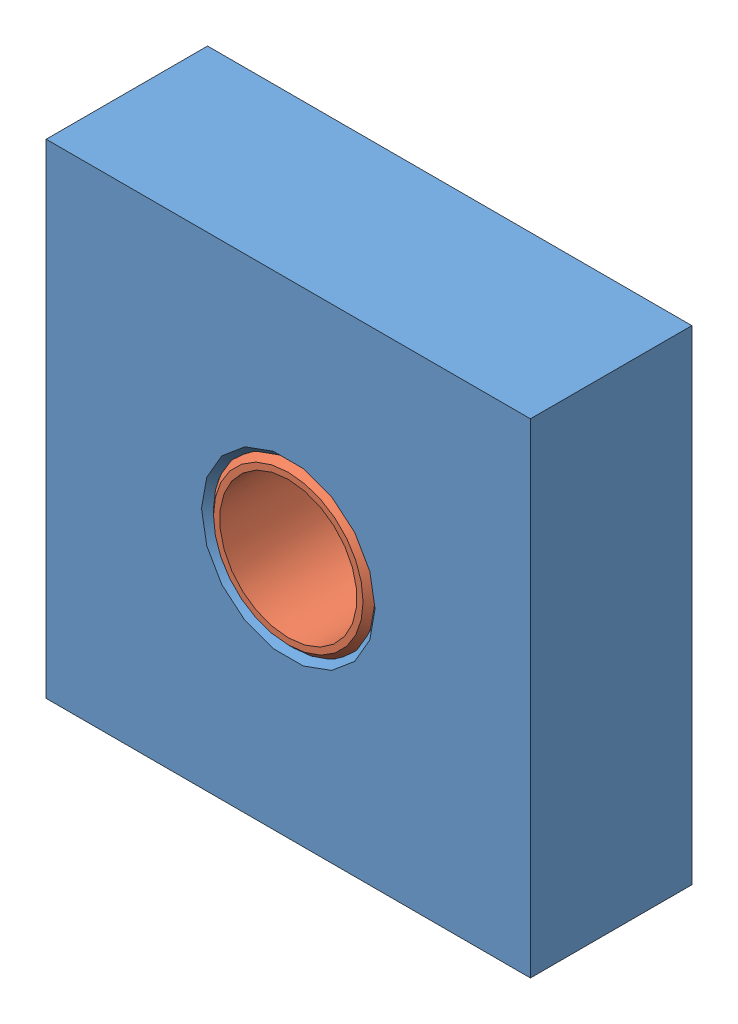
SolidWorks assembly Bushing and Frame 5-1.SLDASM, configuration Default (file format 4100). Lengths in mm.
Overall size (120 120 40).
2 component instances, 2 part files, 2 mates.
Components (placement in the parent):
- Frame-1: Frame.SLDPRT [Default] at origin size (120 120 40)
- Bushing-2: Bushing.SLDPRT [Default] x (1 0 0) z (0 1 0) size (40.06 40 40.06)
Mates (geometry in assembly coordinates):
- Concentric1: concentric anti-aligned: cylinder of Frame-1; cylinder of Bushing-2
- Coincident1: coincident aligned: plane of Frame-1 through (-60 -60 20) normal (0 0 1); plane of Bushing-2 through (0 0 20) normal (0 0 1)
